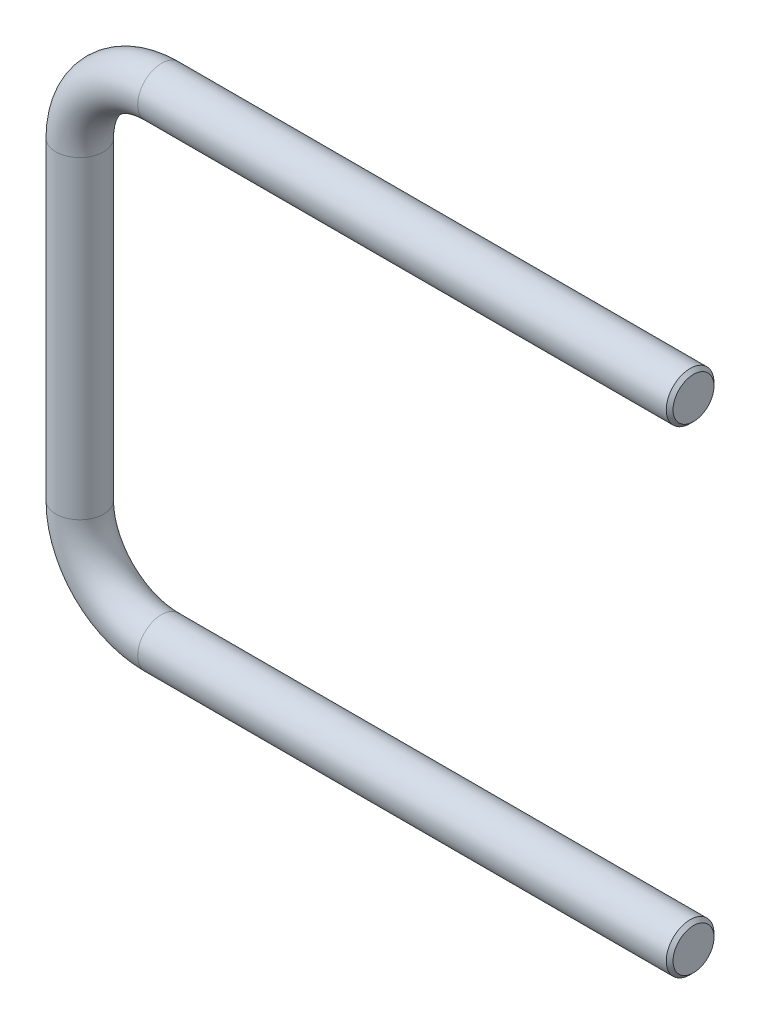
ISO-10303-21;
HEADER;
FILE_DESCRIPTION(('STEP AP214'),'2;1');
FILE_NAME('part.step','',(''),(''),'','','');
FILE_SCHEMA(('AUTOMOTIVE_DESIGN { 1 0 10303 214 1 1 1 1 }'));
ENDSEC;
DATA;
#1=APPLICATION_CONTEXT('core data for automotive mechanical design processes');
#2=APPLICATION_PROTOCOL_DEFINITION('international standard','automotive_design',2000,#1);
#3=PRODUCT_CONTEXT('',#1,'mechanical');
#4=PRODUCT('Part','Part','',(#3));
#5=PRODUCT_RELATED_PRODUCT_CATEGORY('part','',(#4));
#6=PRODUCT_DEFINITION_FORMATION('','',#4);
#7=PRODUCT_DEFINITION_CONTEXT('part definition',#1,'design');
#8=PRODUCT_DEFINITION('design','',#6,#7);
#9=PRODUCT_DEFINITION_SHAPE('','',#8);
#10=(LENGTH_UNIT() NAMED_UNIT(*) SI_UNIT(.MILLI.,.METRE.));
#11=(NAMED_UNIT(*) PLANE_ANGLE_UNIT() SI_UNIT($,.RADIAN.));
#12=(NAMED_UNIT(*) SI_UNIT($,.STERADIAN.) SOLID_ANGLE_UNIT());
#13=UNCERTAINTY_MEASURE_WITH_UNIT(LENGTH_MEASURE(1.E-05),#10,'distance_accuracy_value','');
#14=(GEOMETRIC_REPRESENTATION_CONTEXT(3) GLOBAL_UNCERTAINTY_ASSIGNED_CONTEXT((#13)) GLOBAL_UNIT_ASSIGNED_CONTEXT((#10,
#11,#12)) REPRESENTATION_CONTEXT('',''));
#15=CARTESIAN_POINT('',(0.,0.,0.));
#16=DIRECTION('',(0.,0.,1.));
#17=DIRECTION('',(1.,0.,0.));
#18=AXIS2_PLACEMENT_3D('',#15,#16,#17);
#19=CARTESIAN_POINT('',(-78.,70.,0.));
#20=DIRECTION('',(1.,0.,0.));
#21=DIRECTION('',(0.,1.,0.));
#22=AXIS2_PLACEMENT_3D('',#19,#20,#21);
#23=CYLINDRICAL_SURFACE('',#22,3.5);
#24=CARTESIAN_POINT('',(-0.500000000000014,70.,0.));
#25=DIRECTION('',(-1.,0.,0.));
#26=DIRECTION('',(0.,0.,1.));
#27=AXIS2_PLACEMENT_3D('',#24,#25,#26);
#28=CIRCLE('',#27,3.5);
#29=CARTESIAN_POINT('',(-0.500000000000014,70.,3.5));
#30=VERTEX_POINT('',#29);
#31=EDGE_CURVE('E41',#30,#30,#28,.T.);
#32=ORIENTED_EDGE('',*,*,#31,.T.);
#33=EDGE_LOOP('',(#32));
#34=FACE_BOUND('',#33,.T.);
#35=CARTESIAN_POINT('',(-78.,70.,0.));
#36=DIRECTION('',(-1.,0.,0.));
#37=DIRECTION('',(0.,0.,-1.));
#38=AXIS2_PLACEMENT_3D('',#35,#36,#37);
#39=CIRCLE('',#38,3.5);
#40=CARTESIAN_POINT('',(-78.,73.5,0.));
#41=VERTEX_POINT('',#40);
#42=EDGE_CURVE('E46',#41,#41,#39,.T.);
#43=ORIENTED_EDGE('',*,*,#42,.F.);
#44=EDGE_LOOP('',(#43));
#45=FACE_BOUND('',#44,.T.);
#46=ADVANCED_FACE('F27',(#34,#45),#23,.T.);
#47=CARTESIAN_POINT('',(-78.,58.,0.));
#48=DIRECTION('',(0.,0.,-1.));
#49=DIRECTION('',(-1.,0.,0.));
#50=AXIS2_PLACEMENT_3D('',#47,#48,#49);
#51=TOROIDAL_SURFACE('',#50,12.,3.5);
#52=CARTESIAN_POINT('',(-90.,58.,0.));
#53=DIRECTION('',(0.,-1.,0.));
#54=DIRECTION('',(0.,0.,-1.));
#55=AXIS2_PLACEMENT_3D('',#52,#53,#54);
#56=CIRCLE('',#55,3.5);
#57=CARTESIAN_POINT('',(-93.5,58.,0.));
#58=VERTEX_POINT('',#57);
#59=EDGE_CURVE('E49',#58,#58,#56,.T.);
#60=CARTESIAN_POINT('',(-78.,58.,0.));
#61=DIRECTION('',(0.,0.,-1.));
#62=DIRECTION('',(-1.,0.,0.));
#63=AXIS2_PLACEMENT_3D('',#60,#61,#62);
#64=CIRCLE('',#63,15.5);
#65=EDGE_CURVE('',#58,#41,#64,.T.);
#66=ORIENTED_EDGE('',*,*,#59,.F.);
#67=ORIENTED_EDGE('',*,*,#42,.T.);
#68=ORIENTED_EDGE('',*,*,#65,.T.);
#69=ORIENTED_EDGE('',*,*,#65,.F.);
#70=EDGE_LOOP('',(#66,#68,#67,#69));
#71=FACE_BOUND('',#70,.T.);
#72=ADVANCED_FACE('F70',(#71),#51,.T.);
#73=CARTESIAN_POINT('',(-90.,12.,0.));
#74=DIRECTION('',(0.,1.,0.));
#75=DIRECTION('',(0.,0.,1.));
#76=AXIS2_PLACEMENT_3D('',#73,#74,#75);
#77=CYLINDRICAL_SURFACE('',#76,3.5);
#78=CARTESIAN_POINT('',(-90.,12.,0.));
#79=DIRECTION('',(0.,-1.,0.));
#80=DIRECTION('',(0.,0.,-1.));
#81=AXIS2_PLACEMENT_3D('',#78,#79,#80);
#82=CIRCLE('',#81,3.5);
#83=CARTESIAN_POINT('',(-93.5,12.,0.));
#84=VERTEX_POINT('',#83);
#85=EDGE_CURVE('E52',#84,#84,#82,.T.);
#86=ORIENTED_EDGE('',*,*,#85,.F.);
#87=EDGE_LOOP('',(#86));
#88=FACE_BOUND('',#87,.T.);
#89=ORIENTED_EDGE('',*,*,#59,.T.);
#90=EDGE_LOOP('',(#89));
#91=FACE_BOUND('',#90,.T.);
#92=ADVANCED_FACE('F64',(#88,#91),#77,.T.);
#93=CARTESIAN_POINT('',(-78.,12.,0.));
#94=DIRECTION('',(0.,0.,-1.));
#95=DIRECTION('',(-1.,0.,0.));
#96=AXIS2_PLACEMENT_3D('',#93,#94,#95);
#97=TOROIDAL_SURFACE('',#96,12.,3.5);
#98=CARTESIAN_POINT('',(-78.,0.,0.));
#99=DIRECTION('',(1.,0.,0.));
#100=DIRECTION('',(0.,0.,-1.));
#101=AXIS2_PLACEMENT_3D('',#98,#99,#100);
#102=CIRCLE('',#101,3.5);
#103=CARTESIAN_POINT('',(-78.,-3.50000000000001,0.));
#104=VERTEX_POINT('',#103);
#105=EDGE_CURVE('E55',#104,#104,#102,.T.);
#106=CARTESIAN_POINT('',(-78.,12.,0.));
#107=DIRECTION('',(0.,0.,-1.));
#108=DIRECTION('',(-1.,0.,0.));
#109=AXIS2_PLACEMENT_3D('',#106,#107,#108);
#110=CIRCLE('',#109,15.5);
#111=EDGE_CURVE('',#104,#84,#110,.T.);
#112=ORIENTED_EDGE('',*,*,#105,.F.);
#113=ORIENTED_EDGE('',*,*,#85,.T.);
#114=ORIENTED_EDGE('',*,*,#111,.T.);
#115=ORIENTED_EDGE('',*,*,#111,.F.);
#116=EDGE_LOOP('',(#112,#114,#113,#115));
#117=FACE_BOUND('',#116,.T.);
#118=ADVANCED_FACE('F61',(#117),#97,.T.);
#119=CARTESIAN_POINT('',(-78.,0.,0.));
#120=DIRECTION('',(1.,0.,0.));
#121=DIRECTION('',(0.,1.,0.));
#122=AXIS2_PLACEMENT_3D('',#119,#120,#121);
#123=CYLINDRICAL_SURFACE('',#122,3.5);
#124=CARTESIAN_POINT('',(-0.5,0.,0.));
#125=DIRECTION('',(1.,0.,0.));
#126=DIRECTION('',(0.,1.,0.));
#127=AXIS2_PLACEMENT_3D('',#124,#125,#126);
#128=CIRCLE('',#127,3.5);
#129=CARTESIAN_POINT('',(-0.500000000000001,3.5,0.));
#130=VERTEX_POINT('',#129);
#131=EDGE_CURVE('E10',#130,#130,#128,.F.);
#132=ORIENTED_EDGE('',*,*,#131,.T.);
#133=EDGE_LOOP('',(#132));
#134=FACE_BOUND('',#133,.T.);
#135=ORIENTED_EDGE('',*,*,#105,.T.);
#136=EDGE_LOOP('',(#135));
#137=FACE_BOUND('',#136,.T.);
#138=ADVANCED_FACE('F59',(#134,#137),#123,.T.);
#139=CARTESIAN_POINT('',(0.,70.,0.));
#140=DIRECTION('',(-1.,0.,0.));
#141=DIRECTION('',(0.,0.,-1.));
#142=AXIS2_PLACEMENT_3D('',#139,#140,#141);
#143=PLANE('',#142);
#144=CARTESIAN_POINT('',(0.,70.,0.));
#145=DIRECTION('',(-1.,0.,0.));
#146=DIRECTION('',(0.,-1.,0.));
#147=AXIS2_PLACEMENT_3D('',#144,#145,#146);
#148=CIRCLE('',#147,3.);
#149=CARTESIAN_POINT('',(0.,67.,0.));
#150=VERTEX_POINT('',#149);
#151=EDGE_CURVE('E37',#150,#150,#148,.F.);
#152=ORIENTED_EDGE('',*,*,#151,.T.);
#153=EDGE_LOOP('',(#152));
#154=FACE_BOUND('',#153,.T.);
#155=ADVANCED_FACE('F96',(#154),#143,.F.);
#156=CARTESIAN_POINT('',(0.,0.,0.));
#157=DIRECTION('',(1.,0.,0.));
#158=DIRECTION('',(0.,0.,-1.));
#159=AXIS2_PLACEMENT_3D('',#156,#157,#158);
#160=PLANE('',#159);
#161=CARTESIAN_POINT('',(0.,0.,0.));
#162=DIRECTION('',(1.,0.,0.));
#163=DIRECTION('',(0.,0.,-1.));
#164=AXIS2_PLACEMENT_3D('',#161,#162,#163);
#165=CIRCLE('',#164,2.99999999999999);
#166=CARTESIAN_POINT('',(0.,0.,-2.99999999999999));
#167=VERTEX_POINT('',#166);
#168=EDGE_CURVE('E33',#167,#167,#165,.T.);
#169=ORIENTED_EDGE('',*,*,#168,.T.);
#170=EDGE_LOOP('',(#169));
#171=FACE_BOUND('',#170,.T.);
#172=ADVANCED_FACE('F87',(#171),#160,.T.);
#173=CARTESIAN_POINT('',(-0.500000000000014,70.,0.));
#174=DIRECTION('',(-1.,0.,0.));
#175=DIRECTION('',(0.,0.,1.));
#176=AXIS2_PLACEMENT_3D('',#173,#174,#175);
#177=CONICAL_SURFACE('',#176,3.5,0.785398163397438);
#178=ORIENTED_EDGE('',*,*,#151,.F.);
#179=EDGE_LOOP('',(#178));
#180=FACE_BOUND('',#179,.T.);
#181=ORIENTED_EDGE('',*,*,#31,.F.);
#182=EDGE_LOOP('',(#181));
#183=FACE_BOUND('',#182,.T.);
#184=ADVANCED_FACE('F84',(#180,#183),#177,.T.);
#185=CARTESIAN_POINT('',(0.,0.,0.));
#186=DIRECTION('',(-1.,0.,0.));
#187=DIRECTION('',(0.,-1.,0.));
#188=AXIS2_PLACEMENT_3D('',#185,#186,#187);
#189=CONICAL_SURFACE('',#188,2.99999999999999,0.785398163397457);
#190=ORIENTED_EDGE('',*,*,#131,.F.);
#191=EDGE_LOOP('',(#190));
#192=FACE_BOUND('',#191,.T.);
#193=ORIENTED_EDGE('',*,*,#168,.F.);
#194=EDGE_LOOP('',(#193));
#195=FACE_BOUND('',#194,.T.);
#196=ADVANCED_FACE('F86',(#192,#195),#189,.T.);
#197=CLOSED_SHELL('',(#46,#72,#92,#118,#138,#155,#172,#184,#196));
#198=MANIFOLD_SOLID_BREP('B2',#197);
#199=ADVANCED_BREP_SHAPE_REPRESENTATION('',(#18,#198),#14);
#200=SHAPE_DEFINITION_REPRESENTATION(#9,#199);
ENDSEC;
END-ISO-10303-21;
